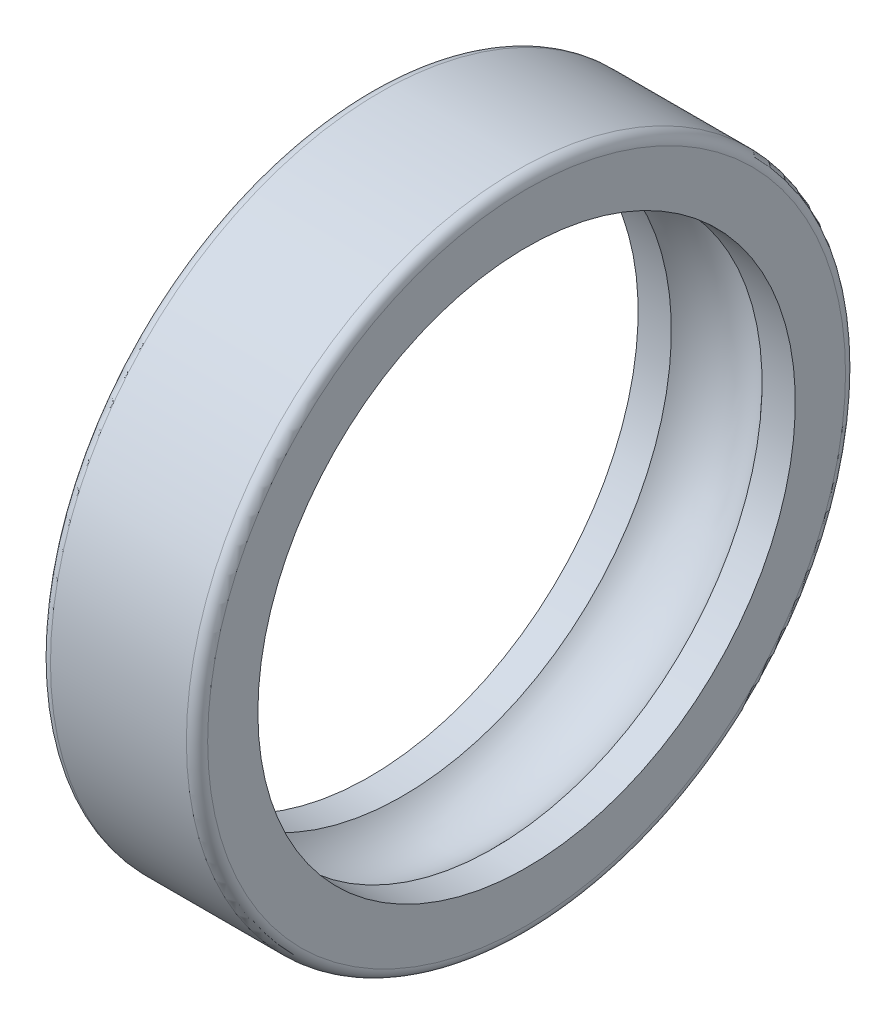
from build123d import *

# Parameters (mm, degrees)
FILLET1_R = 2.1


with BuildPart() as part:
    # Sketch1 → Revolve1 (revolve)
    with BuildSketch(Plane.XY, mode=Mode.PRIVATE) as revolve1_sk:
        with BuildLine():
            Line((8.94427191, 53), (15.5, 53))
            Line((15.5, 53), (15.5, 65))
            Line((15.5, 65), (-15.5, 65))
            Line((-15.5, 65), (-15.5, 53))
            Line((-15.5, 53), (-8.94427191, 53))
            ThreePointArc((-8.94427191, 53), (0, 57), (8.94427191, 53))
        make_face()
    revolve(revolve1_sk.sketch.rotate(Axis((-19.566831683, 0, 0), (1, 0, 0)), 90), axis=Axis((-19.566831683, 0, 0), (1, 0, 0)))

    # Fillet1
    fillet1_edges = [part.edges().sort_by_distance(p)[0] for p in [
        (15.5, 0, -65),
        (-15.5, 0, -65),
    ]]
    fillet(fillet1_edges, radius=FILLET1_R)


solid = part.part
